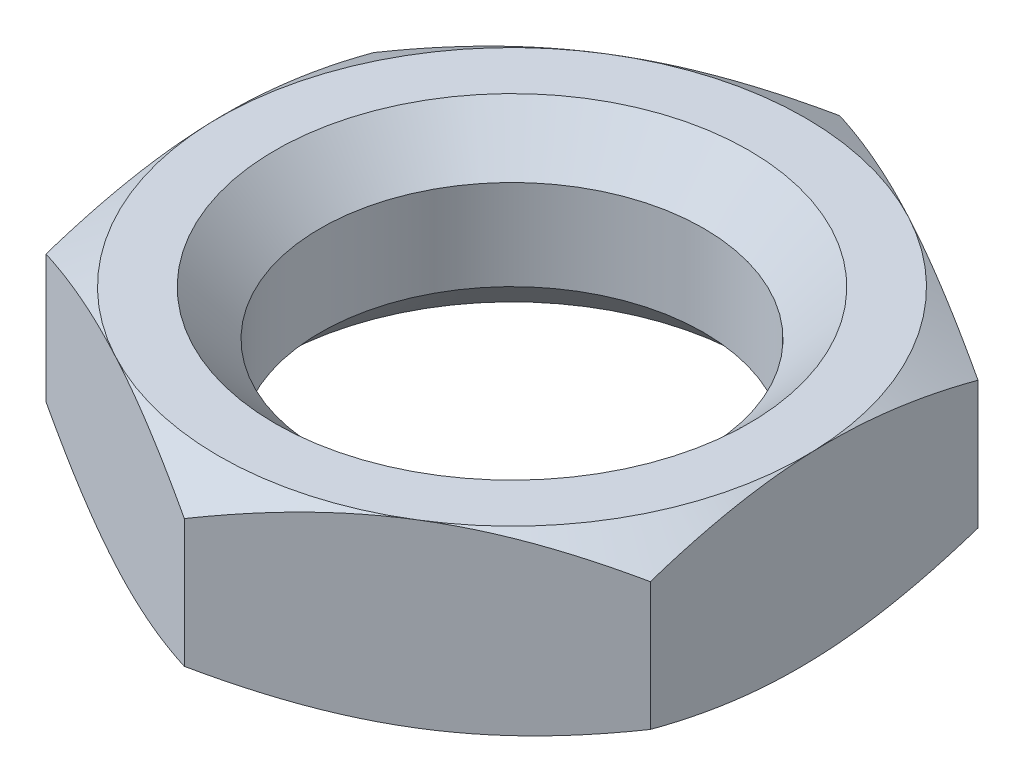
ISO-10303-21;
HEADER;
FILE_DESCRIPTION(('STEP AP214'),'2;1');
FILE_NAME('part.step','',(''),(''),'','','');
FILE_SCHEMA(('AUTOMOTIVE_DESIGN { 1 0 10303 214 1 1 1 1 }'));
ENDSEC;
DATA;
#1=APPLICATION_CONTEXT('core data for automotive mechanical design processes');
#2=APPLICATION_PROTOCOL_DEFINITION('international standard','automotive_design',2000,#1);
#3=PRODUCT_CONTEXT('',#1,'mechanical');
#4=PRODUCT('Part','Part','',(#3));
#5=PRODUCT_RELATED_PRODUCT_CATEGORY('part','',(#4));
#6=PRODUCT_DEFINITION_FORMATION('','',#4);
#7=PRODUCT_DEFINITION_CONTEXT('part definition',#1,'design');
#8=PRODUCT_DEFINITION('design','',#6,#7);
#9=PRODUCT_DEFINITION_SHAPE('','',#8);
#10=(LENGTH_UNIT() NAMED_UNIT(*) SI_UNIT(.MILLI.,.METRE.));
#11=(NAMED_UNIT(*) PLANE_ANGLE_UNIT() SI_UNIT($,.RADIAN.));
#12=(NAMED_UNIT(*) SI_UNIT($,.STERADIAN.) SOLID_ANGLE_UNIT());
#13=UNCERTAINTY_MEASURE_WITH_UNIT(LENGTH_MEASURE(1.E-05),#10,'distance_accuracy_value','');
#14=(GEOMETRIC_REPRESENTATION_CONTEXT(3) GLOBAL_UNCERTAINTY_ASSIGNED_CONTEXT((#13)) GLOBAL_UNIT_ASSIGNED_CONTEXT((#10,
#11,#12)) REPRESENTATION_CONTEXT('',''));
#15=CARTESIAN_POINT('',(0.,0.,0.));
#16=DIRECTION('',(0.,0.,1.));
#17=DIRECTION('',(1.,0.,0.));
#18=AXIS2_PLACEMENT_3D('',#15,#16,#17);
#19=CARTESIAN_POINT('',(6.61460290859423,4.,3.54688055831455));
#20=DIRECTION('',(-0.999507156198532,0.,0.0313917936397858));
#21=DIRECTION('',(0.0313917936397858,0.,0.999507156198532));
#22=AXIS2_PLACEMENT_3D('',#19,#20,#21);
#23=PLANE('',#22);
#24=CARTESIAN_POINT('',(6.37898384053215,0.580614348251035,-3.95517387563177));
#25=CARTESIAN_POINT('',(6.38416287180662,0.532995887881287,-3.79027476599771));
#26=CARTESIAN_POINT('',(6.38936121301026,0.487538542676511,-3.62476083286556));
#27=CARTESIAN_POINT('',(6.399800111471,0.401541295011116,-3.29238881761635));
#28=CARTESIAN_POINT('',(6.40504068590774,0.361003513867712,-3.12553018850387));
#29=CARTESIAN_POINT('',(6.42084631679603,0.247565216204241,-2.62228270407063));
#30=CARTESIAN_POINT('',(6.43147376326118,0.183042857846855,-2.28390736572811));
#31=CARTESIAN_POINT('',(6.44737754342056,0.107382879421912,-1.7775348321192));
#32=CARTESIAN_POINT('',(6.4526063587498,0.0858295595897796,-1.61105061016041));
#33=CARTESIAN_POINT('',(6.46308761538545,0.0496878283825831,-1.27732992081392));
#34=CARTESIAN_POINT('',(6.46834005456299,0.035098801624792,-1.11009352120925));
#35=CARTESIAN_POINT('',(6.47885405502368,0.013257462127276,-0.775330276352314));
#36=CARTESIAN_POINT('',(6.48411559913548,0.00599682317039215,-0.607803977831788));
#37=CARTESIAN_POINT('',(6.49464325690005,-0.00103984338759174,-0.272605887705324));
#38=CARTESIAN_POINT('',(6.49990937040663,-0.000816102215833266,-0.104934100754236));
#39=CARTESIAN_POINT('',(6.51433671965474,0.0100845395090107,0.354429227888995));
#40=CARTESIAN_POINT('',(6.52349323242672,0.0283830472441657,0.645970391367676));
#41=CARTESIAN_POINT('',(6.54174544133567,0.0864071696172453,1.22711633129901));
#42=CARTESIAN_POINT('',(6.55084107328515,0.126152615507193,1.51671906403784));
#43=CARTESIAN_POINT('',(6.56913001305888,0.225504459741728,2.09903450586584));
#44=CARTESIAN_POINT('',(6.57832101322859,0.285531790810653,2.39167373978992));
#45=CARTESIAN_POINT('',(6.59656595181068,0.421769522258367,2.97258819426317));
#46=CARTESIAN_POINT('',(6.60562012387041,0.49794792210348,3.26087085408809));
#47=CARTESIAN_POINT('',(6.61460919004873,0.580614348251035,3.54708055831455));
#48=B_SPLINE_CURVE_WITH_KNOTS('',3,(#24,#25,#26,#27,#28,#29,#30,#31,#32,#33,#34,#35,#36,#37,#38,
#39,#40,#41,#42,#43,#44,#45,#46,#47),.UNSPECIFIED.,.F.,.F.,(4,2,2,2,2,2,2,2,2,2,2,4),(0.,
0.515103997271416,1.03042932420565,2.06322126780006,2.56696865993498,3.07067153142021,
3.57380146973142,4.0769158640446,4.95277182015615,5.82943904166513,6.72554927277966,
7.61990033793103),.UNSPECIFIED.);
#49=CARTESIAN_POINT('',(6.37899012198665,0.580556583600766,-3.95497387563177));
#50=VERTEX_POINT('',#49);
#51=CARTESIAN_POINT('',(6.49679651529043,0.,-0.204046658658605));
#52=VERTEX_POINT('',#51);
#53=EDGE_CURVE('E438',#50,#52,#48,.T.);
#54=ORIENTED_EDGE('',*,*,#53,.F.);
#55=DIRECTION('',(0.,-1.,0.));
#56=VECTOR('',#55,1.);
#57=CARTESIAN_POINT('',(6.37899012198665,4.,-3.95497387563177));
#58=LINE('',#57,#56);
#59=CARTESIAN_POINT('',(6.37899012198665,3.41944341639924,-3.95497387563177));
#60=VERTEX_POINT('',#59);
#61=EDGE_CURVE('E554',#60,#50,#58,.T.);
#62=ORIENTED_EDGE('',*,*,#61,.F.);
#63=CARTESIAN_POINT('',(6.61460919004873,3.41938565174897,3.54708055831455));
#64=CARTESIAN_POINT('',(6.60943015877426,3.46700411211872,3.3821814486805));
#65=CARTESIAN_POINT('',(6.60423181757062,3.5124614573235,3.21666751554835));
#66=CARTESIAN_POINT('',(6.59379291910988,3.59845870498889,2.88429550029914));
#67=CARTESIAN_POINT('',(6.58855234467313,3.6389964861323,2.71743687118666));
#68=CARTESIAN_POINT('',(6.57274671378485,3.75243478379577,2.21418938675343));
#69=CARTESIAN_POINT('',(6.5621192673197,3.81695714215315,1.8758140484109));
#70=CARTESIAN_POINT('',(6.54621548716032,3.8926171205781,1.36944151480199));
#71=CARTESIAN_POINT('',(6.54098667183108,3.91417044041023,1.2029572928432));
#72=CARTESIAN_POINT('',(6.53050541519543,3.95031217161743,0.86923660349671));
#73=CARTESIAN_POINT('',(6.52525297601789,3.96490119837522,0.702000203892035));
#74=CARTESIAN_POINT('',(6.5147389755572,3.98674253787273,0.367236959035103));
#75=CARTESIAN_POINT('',(6.5094774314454,3.99400317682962,0.199710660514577));
#76=CARTESIAN_POINT('',(6.49894977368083,4.0010398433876,-0.135487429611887));
#77=CARTESIAN_POINT('',(6.49368366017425,4.00081610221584,-0.303159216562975));
#78=CARTESIAN_POINT('',(6.47925631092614,3.989915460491,-0.762522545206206));
#79=CARTESIAN_POINT('',(6.47009979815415,3.97161695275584,-1.05406370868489));
#80=CARTESIAN_POINT('',(6.45184758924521,3.91359283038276,-1.63520964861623));
#81=CARTESIAN_POINT('',(6.44275195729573,3.87384738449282,-1.92481238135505));
#82=CARTESIAN_POINT('',(6.424463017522,3.77449554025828,-2.50712782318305));
#83=CARTESIAN_POINT('',(6.41527201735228,3.71446820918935,-2.79976705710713));
#84=CARTESIAN_POINT('',(6.3970270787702,3.57823047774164,-3.38068151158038));
#85=CARTESIAN_POINT('',(6.38797290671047,3.50205207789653,-3.6689641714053));
#86=CARTESIAN_POINT('',(6.37898384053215,3.41938565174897,-3.95517387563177));
#87=B_SPLINE_CURVE_WITH_KNOTS('',3,(#63,#64,#65,#66,#67,#68,#69,#70,#71,#72,#73,#74,#75,#76,#77,
#78,#79,#80,#81,#82,#83,#84,#85,#86),.UNSPECIFIED.,.F.,.F.,(4,2,2,2,2,2,2,2,2,2,2,4),(0.,
0.515103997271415,1.03042932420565,2.06322126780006,2.56696865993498,3.07067153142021,
3.57380146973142,4.0769158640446,4.95277182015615,5.82943904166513,6.72554927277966,
7.61990033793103),.UNSPECIFIED.);
#88=CARTESIAN_POINT('',(6.49679651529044,4.,-0.204046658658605));
#89=VERTEX_POINT('',#88);
#90=EDGE_CURVE('E535',#89,#60,#87,.T.);
#91=ORIENTED_EDGE('',*,*,#90,.F.);
#92=CARTESIAN_POINT('',(6.61460290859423,3.41944341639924,3.54688055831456));
#93=VERTEX_POINT('',#92);
#94=EDGE_CURVE('E540',#93,#89,#87,.T.);
#95=ORIENTED_EDGE('',*,*,#94,.F.);
#96=DIRECTION('',(0.,-1.,0.));
#97=VECTOR('',#96,1.);
#98=CARTESIAN_POINT('',(6.61460290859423,4.,3.54688055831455));
#99=LINE('',#98,#97);
#100=CARTESIAN_POINT('',(6.61460290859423,0.580556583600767,3.54688055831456));
#101=VERTEX_POINT('',#100);
#102=EDGE_CURVE('E464',#93,#101,#99,.T.);
#103=ORIENTED_EDGE('',*,*,#102,.T.);
#104=EDGE_CURVE('E447',#52,#101,#48,.T.);
#105=ORIENTED_EDGE('',*,*,#104,.F.);
#106=EDGE_LOOP('',(#54,#62,#91,#95,#103,#105));
#107=FACE_BOUND('',#106,.T.);
#108=ADVANCED_FACE('F351',(#107),#23,.F.);
#109=CARTESIAN_POINT('',(6.37899012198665,4.,-3.95497387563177));
#110=DIRECTION('',(-0.472567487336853,0.,0.881294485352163));
#111=DIRECTION('',(0.881294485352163,0.,0.472567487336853));
#112=AXIS2_PLACEMENT_3D('',#109,#110,#111);
#113=PLANE('',#112);
#114=CARTESIAN_POINT('',(-0.235812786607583,0.580622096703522,-7.50196167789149));
#115=CARTESIAN_POINT('',(-0.0904162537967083,0.533003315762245,-7.42399718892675));
#116=CARTESIAN_POINT('',(0.0555223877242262,0.487545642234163,-7.34574201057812));
#117=CARTESIAN_POINT('',(0.348584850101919,0.401547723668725,-7.1885961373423));
#118=CARTESIAN_POINT('',(0.495709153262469,0.361009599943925,-7.1097051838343));
#119=CARTESIAN_POINT('',(0.939437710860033,0.247570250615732,-6.87176917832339));
#120=CARTESIAN_POINT('',(1.23779351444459,0.183047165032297,-6.71178491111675));
#121=CARTESIAN_POINT('',(1.68427754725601,0.10738610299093,-6.47237136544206));
#122=CARTESIAN_POINT('',(1.8310717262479,0.0858324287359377,-6.39365743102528));
#123=CARTESIAN_POINT('',(2.12532337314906,0.0496899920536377,-6.23587389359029));
#124=CARTESIAN_POINT('',(2.27278078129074,0.0351006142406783,-6.15680432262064));
#125=CARTESIAN_POINT('',(2.56795170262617,0.0132585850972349,-5.99852785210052));
#126=CARTESIAN_POINT('',(2.71566473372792,0.00599760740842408,-5.91932121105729));
#127=CARTESIAN_POINT('',(3.01121909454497,-0.0010397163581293,-5.76083913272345));
#128=CARTESIAN_POINT('',(3.15906042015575,-0.00081629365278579,-5.68156369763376));
#129=CARTESIAN_POINT('',(3.56409815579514,0.0100835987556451,-5.46437447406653));
#130=CARTESIAN_POINT('',(3.82116198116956,0.0283819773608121,-5.32653178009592));
#131=CARTESIAN_POINT('',(4.33358223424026,0.0864064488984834,-5.05176193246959));
#132=CARTESIAN_POINT('',(4.58893685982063,0.126152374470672,-4.91483574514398));
#133=CARTESIAN_POINT('',(5.10238836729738,0.225505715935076,-4.63951291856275));
#134=CARTESIAN_POINT('',(5.36042046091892,0.285534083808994,-4.50115102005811));
#135=CARTESIAN_POINT('',(5.87263664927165,0.421774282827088,-4.22649059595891));
#136=CARTESIAN_POINT('',(6.12682730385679,0.497954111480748,-4.09018855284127));
#137=CARTESIAN_POINT('',(6.37919012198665,0.580622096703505,-3.95486663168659));
#138=B_SPLINE_CURVE_WITH_KNOTS('',3,(#114,#115,#116,#117,#118,#119,#120,#121,#122,#123,#124,
#125,#126,#127,#128,#129,#130,#131,#132,#133,#134,#135,#136,#137),.UNSPECIFIED.,.F.,.F.,(4,2,2,
2,2,2,2,2,2,2,2,4),(0.,0.515104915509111,1.03043116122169,2.06322499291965,2.5669732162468,
3.07067691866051,3.57380767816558,4.07692289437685,4.95279072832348,5.82946987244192,
6.72559265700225,7.61995618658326),.UNSPECIFIED.);
#139=CARTESIAN_POINT('',(-0.235612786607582,0.580556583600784,-7.50185443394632));
#140=VERTEX_POINT('',#139);
#141=CARTESIAN_POINT('',(3.07168866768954,0.,-5.728414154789));
#142=VERTEX_POINT('',#141);
#143=EDGE_CURVE('E507',#140,#142,#138,.T.);
#144=ORIENTED_EDGE('',*,*,#143,.F.);
#145=DIRECTION('',(0.,-1.,0.));
#146=VECTOR('',#145,1.);
#147=CARTESIAN_POINT('',(-0.235612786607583,4.,-7.50185443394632));
#148=LINE('',#147,#146);
#149=CARTESIAN_POINT('',(-0.235612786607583,3.41944341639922,-7.50185443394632));
#150=VERTEX_POINT('',#149);
#151=EDGE_CURVE('E551',#150,#140,#148,.T.);
#152=ORIENTED_EDGE('',*,*,#151,.F.);
#153=CARTESIAN_POINT('',(6.37919012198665,3.4193779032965,-3.95486663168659));
#154=CARTESIAN_POINT('',(6.23379358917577,3.46699668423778,-4.03283112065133));
#155=CARTESIAN_POINT('',(6.08785494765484,3.51245435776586,-4.11108629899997));
#156=CARTESIAN_POINT('',(5.79479248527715,3.5984522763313,-4.26823217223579));
#157=CARTESIAN_POINT('',(5.6476681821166,3.6389904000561,-4.34712312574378));
#158=CARTESIAN_POINT('',(5.20393962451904,3.75242974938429,-4.58505913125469));
#159=CARTESIAN_POINT('',(4.90558382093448,3.81695283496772,-4.74504339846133));
#160=CARTESIAN_POINT('',(4.45909978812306,3.89261389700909,-4.98445694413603));
#161=CARTESIAN_POINT('',(4.31230560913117,3.91416757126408,-5.0631708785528));
#162=CARTESIAN_POINT('',(4.01805396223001,3.95031000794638,-5.22095441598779));
#163=CARTESIAN_POINT('',(3.87059655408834,3.96489938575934,-5.30002398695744));
#164=CARTESIAN_POINT('',(3.57542563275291,3.98674141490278,-5.45830045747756));
#165=CARTESIAN_POINT('',(3.42771260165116,3.99400239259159,-5.53750709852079));
#166=CARTESIAN_POINT('',(3.1321582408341,4.00103971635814,-5.69598917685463));
#167=CARTESIAN_POINT('',(2.98431691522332,4.00081629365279,-5.77526461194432));
#168=CARTESIAN_POINT('',(2.57927917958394,3.98991640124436,-5.99245383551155));
#169=CARTESIAN_POINT('',(2.32221535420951,3.97161802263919,-6.13029652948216));
#170=CARTESIAN_POINT('',(1.80979510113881,3.91359355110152,-6.40506637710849));
#171=CARTESIAN_POINT('',(1.55444047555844,3.87384762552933,-6.5419925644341));
#172=CARTESIAN_POINT('',(1.04098896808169,3.77449428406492,-6.81731539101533));
#173=CARTESIAN_POINT('',(0.782956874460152,3.714465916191,-6.95567728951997));
#174=CARTESIAN_POINT('',(0.270740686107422,3.5782257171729,-7.23033771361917));
#175=CARTESIAN_POINT('',(0.0165500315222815,3.50204588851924,-7.36663975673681));
#176=CARTESIAN_POINT('',(-0.235812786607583,3.41937790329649,-7.50196167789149));
#177=B_SPLINE_CURVE_WITH_KNOTS('',3,(#153,#154,#155,#156,#157,#158,#159,#160,#161,#162,#163,
#164,#165,#166,#167,#168,#169,#170,#171,#172,#173,#174,#175,#176),.UNSPECIFIED.,.F.,.F.,(4,2,2,
2,2,2,2,2,2,2,2,4),(0.,0.515104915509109,1.03043116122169,2.06322499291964,2.56697321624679,
3.0706769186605,3.57380767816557,4.07692289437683,4.95279072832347,5.82946987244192,
6.72559265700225,7.61995618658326),.UNSPECIFIED.);
#178=CARTESIAN_POINT('',(3.07168866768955,4.,-5.72841415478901));
#179=VERTEX_POINT('',#178);
#180=EDGE_CURVE('E522',#179,#150,#177,.T.);
#181=ORIENTED_EDGE('',*,*,#180,.F.);
#182=EDGE_CURVE('E528',#60,#179,#177,.T.);
#183=ORIENTED_EDGE('',*,*,#182,.F.);
#184=ORIENTED_EDGE('',*,*,#61,.T.);
#185=EDGE_CURVE('E441',#142,#50,#138,.T.);
#186=ORIENTED_EDGE('',*,*,#185,.F.);
#187=EDGE_LOOP('',(#144,#152,#181,#183,#184,#186));
#188=FACE_BOUND('',#187,.T.);
#189=ADVANCED_FACE('F514',(#188),#113,.F.);
#190=CARTESIAN_POINT('',(-0.235612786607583,4.,-7.50185443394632));
#191=DIRECTION('',(0.52693966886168,0.,0.849902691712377));
#192=DIRECTION('',(0.849902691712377,0.,-0.52693966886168));
#193=AXIS2_PLACEMENT_3D('',#190,#191,#192);
#194=PLANE('',#193);
#195=CARTESIAN_POINT('',(-6.61480290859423,0.580624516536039,-3.54675655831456));
#196=CARTESIAN_POINT('',(-6.47458535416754,0.533005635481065,-3.6336914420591));
#197=CARTESIAN_POINT('',(-6.33384500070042,0.487547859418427,-3.72095046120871));
#198=CARTESIAN_POINT('',(-6.05122132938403,0.401549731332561,-3.89617713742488));
#199=CARTESIAN_POINT('',(-5.90933754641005,0.361011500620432,-3.98414508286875));
#200=CARTESIAN_POINT('',(-5.48141445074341,0.24757182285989,-4.24945740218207));
#201=CARTESIAN_POINT('',(-5.19368597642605,0.183048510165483,-4.42784905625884));
#202=CARTESIAN_POINT('',(-4.76310554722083,0.107387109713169,-4.69480892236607));
#203=CARTESIAN_POINT('',(-4.62154012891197,0.0858333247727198,-4.78257948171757));
#204=CARTESIAN_POINT('',(-4.33776962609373,0.0496906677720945,-4.95851719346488));
#205=CARTESIAN_POINT('',(-4.19556459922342,0.0351011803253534,-5.04668431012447));
#206=CARTESIAN_POINT('',(-3.91090755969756,0.0132589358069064,-5.22317167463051));
#207=CARTESIAN_POINT('',(-3.76845601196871,0.00599785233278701,-5.3114916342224));
#208=CARTESIAN_POINT('',(-3.48342918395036,-0.00103967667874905,-5.48820826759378));
#209=CARTESIAN_POINT('',(-3.34085390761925,-0.000816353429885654,-5.57660493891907));
#210=CARTESIAN_POINT('',(-2.95024252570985,0.0100833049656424,-5.8187839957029));
#211=CARTESIAN_POINT('',(-2.70233427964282,0.0283816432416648,-5.97248710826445));
#212=CARTESIAN_POINT('',(-2.20816437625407,0.0864062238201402,-6.27887244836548));
#213=CARTESIAN_POINT('',(-1.96190445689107,0.126152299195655,-6.43155359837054));
#214=CARTESIAN_POINT('',(-1.46674001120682,0.225506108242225,-6.73855555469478));
#215=CARTESIAN_POINT('',(-1.21789796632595,0.285534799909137,-6.89283762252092));
#216=CARTESIAN_POINT('',(-0.723924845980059,0.4217757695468,-7.19910095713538));
#217=CARTESIAN_POINT('',(-0.47878744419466,0.497956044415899,-7.35108614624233));
#218=CARTESIAN_POINT('',(-0.235412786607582,0.580624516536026,-7.50197843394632));
#219=B_SPLINE_CURVE_WITH_KNOTS('',3,(#195,#196,#197,#198,#199,#200,#201,#202,#203,#204,#205,
#206,#207,#208,#209,#210,#211,#212,#213,#214,#215,#216,#217,#218),.UNSPECIFIED.,.F.,.F.,(4,2,2,
2,2,2,2,2,2,2,2,4),(0.,0.515105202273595,1.0304317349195,2.06322615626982,2.56697463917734,
3.07067860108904,3.57380961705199,4.07692508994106,4.95279663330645,5.82947950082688,
6.72560620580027,7.61997362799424),.UNSPECIFIED.);
#220=CARTESIAN_POINT('',(-6.61460290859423,0.580556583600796,-3.54688055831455));
#221=VERTEX_POINT('',#220);
#222=CARTESIAN_POINT('',(-3.42510784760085,0.,-5.52436749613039));
#223=VERTEX_POINT('',#222);
#224=EDGE_CURVE('E636',#221,#223,#219,.T.);
#225=ORIENTED_EDGE('',*,*,#224,.F.);
#226=DIRECTION('',(0.,-1.,0.));
#227=VECTOR('',#226,1.);
#228=CARTESIAN_POINT('',(-6.61460290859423,4.,-3.54688055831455));
#229=LINE('',#228,#227);
#230=CARTESIAN_POINT('',(-6.61460290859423,3.41944341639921,-3.54688055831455));
#231=VERTEX_POINT('',#230);
#232=EDGE_CURVE('E548',#231,#221,#229,.T.);
#233=ORIENTED_EDGE('',*,*,#232,.F.);
#234=CARTESIAN_POINT('',(-0.235412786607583,3.41937548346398,-7.50197843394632));
#235=CARTESIAN_POINT('',(-0.375630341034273,3.46699436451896,-7.41504355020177));
#236=CARTESIAN_POINT('',(-0.516370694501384,3.51245214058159,-7.32778453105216));
#237=CARTESIAN_POINT('',(-0.798994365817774,3.59845026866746,-7.152557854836));
#238=CARTESIAN_POINT('',(-0.940878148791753,3.63898849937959,-7.06458990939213));
#239=CARTESIAN_POINT('',(-1.36880124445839,3.75242817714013,-6.79927759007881));
#240=CARTESIAN_POINT('',(-1.65652971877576,3.81695148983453,-6.62088593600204));
#241=CARTESIAN_POINT('',(-2.08711014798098,3.89261289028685,-6.3539260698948));
#242=CARTESIAN_POINT('',(-2.22867556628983,3.91416667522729,-6.26615551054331));
#243=CARTESIAN_POINT('',(-2.51244606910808,3.95030933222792,-6.090217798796));
#244=CARTESIAN_POINT('',(-2.65465109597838,3.96489881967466,-6.00205068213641));
#245=CARTESIAN_POINT('',(-2.93930813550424,3.9867410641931,-5.82556331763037));
#246=CARTESIAN_POINT('',(-3.0817596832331,3.99400214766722,-5.73724335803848));
#247=CARTESIAN_POINT('',(-3.36678651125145,4.00103967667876,-5.5605267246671));
#248=CARTESIAN_POINT('',(-3.50936178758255,4.00081635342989,-5.47213005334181));
#249=CARTESIAN_POINT('',(-3.89997316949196,3.98991669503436,-5.22995099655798));
#250=CARTESIAN_POINT('',(-4.14788141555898,3.97161835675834,-5.07624788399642));
#251=CARTESIAN_POINT('',(-4.64205131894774,3.91359377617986,-4.76986254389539));
#252=CARTESIAN_POINT('',(-4.88831123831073,3.87384770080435,-4.61718139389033));
#253=CARTESIAN_POINT('',(-5.38347568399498,3.77449389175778,-4.3101794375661));
#254=CARTESIAN_POINT('',(-5.63231772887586,3.71446520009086,-4.15589736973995));
#255=CARTESIAN_POINT('',(-6.12629084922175,3.5782242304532,-3.84963403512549));
#256=CARTESIAN_POINT('',(-6.37142825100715,3.5020439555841,-3.69764884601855));
#257=CARTESIAN_POINT('',(-6.61480290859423,3.41937548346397,-3.54675655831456));
#258=B_SPLINE_CURVE_WITH_KNOTS('',3,(#234,#235,#236,#237,#238,#239,#240,#241,#242,#243,#244,
#245,#246,#247,#248,#249,#250,#251,#252,#253,#254,#255,#256,#257),.UNSPECIFIED.,.F.,.F.,(4,2,2,
2,2,2,2,2,2,2,2,4),(0.,0.515105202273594,1.0304317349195,2.06322615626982,2.56697463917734,
3.07067860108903,3.57380961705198,4.07692508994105,4.95279663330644,5.82947950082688,
6.72560620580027,7.61997362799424),.UNSPECIFIED.);
#259=CARTESIAN_POINT('',(-3.42510784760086,4.,-5.52436749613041));
#260=VERTEX_POINT('',#259);
#261=EDGE_CURVE('E530',#260,#231,#258,.T.);
#262=ORIENTED_EDGE('',*,*,#261,.F.);
#263=EDGE_CURVE('E529',#150,#260,#258,.T.);
#264=ORIENTED_EDGE('',*,*,#263,.F.);
#265=ORIENTED_EDGE('',*,*,#151,.T.);
#266=EDGE_CURVE('E508',#223,#140,#219,.T.);
#267=ORIENTED_EDGE('',*,*,#266,.F.);
#268=EDGE_LOOP('',(#225,#233,#262,#264,#265,#267));
#269=FACE_BOUND('',#268,.T.);
#270=ADVANCED_FACE('F517',(#269),#194,.F.);
#271=CARTESIAN_POINT('',(-6.61460290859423,4.,-3.54688055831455));
#272=DIRECTION('',(0.999507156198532,0.,-0.0313917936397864));
#273=DIRECTION('',(-0.0313917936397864,0.,-0.999507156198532));
#274=AXIS2_PLACEMENT_3D('',#271,#272,#273);
#275=PLANE('',#274);
#276=CARTESIAN_POINT('',(-6.37898384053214,0.580614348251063,3.95517387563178));
#277=CARTESIAN_POINT('',(-6.38416287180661,0.532995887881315,3.79027476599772));
#278=CARTESIAN_POINT('',(-6.38936121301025,0.487538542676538,3.62476083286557));
#279=CARTESIAN_POINT('',(-6.39980011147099,0.401541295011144,3.29238881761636));
#280=CARTESIAN_POINT('',(-6.40504068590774,0.36100351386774,3.12553018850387));
#281=CARTESIAN_POINT('',(-6.42084631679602,0.24756521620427,2.62228270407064));
#282=CARTESIAN_POINT('',(-6.43147376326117,0.183042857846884,2.28390736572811));
#283=CARTESIAN_POINT('',(-6.44737754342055,0.107382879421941,1.7775348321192));
#284=CARTESIAN_POINT('',(-6.45260635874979,0.0858295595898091,1.6110506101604));
#285=CARTESIAN_POINT('',(-6.46308761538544,0.0496878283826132,1.27732992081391));
#286=CARTESIAN_POINT('',(-6.46834005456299,0.0350988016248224,1.11009352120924));
#287=CARTESIAN_POINT('',(-6.47885405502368,0.0132574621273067,0.775330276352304));
#288=CARTESIAN_POINT('',(-6.48411559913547,0.00599682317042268,0.607803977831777));
#289=CARTESIAN_POINT('',(-6.49464325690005,-0.00103984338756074,0.272605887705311));
#290=CARTESIAN_POINT('',(-6.49990937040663,-0.00081610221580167,0.104934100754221));
#291=CARTESIAN_POINT('',(-6.51433671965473,0.0100845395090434,-0.354429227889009));
#292=CARTESIAN_POINT('',(-6.52349323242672,0.0283830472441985,-0.645970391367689));
#293=CARTESIAN_POINT('',(-6.54174544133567,0.0864071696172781,-1.22711633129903));
#294=CARTESIAN_POINT('',(-6.55084107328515,0.126152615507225,-1.51671906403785));
#295=CARTESIAN_POINT('',(-6.56913001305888,0.22550445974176,-2.09903450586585));
#296=CARTESIAN_POINT('',(-6.57832101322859,0.285531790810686,-2.39167373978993));
#297=CARTESIAN_POINT('',(-6.59656595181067,0.421769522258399,-2.97258819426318));
#298=CARTESIAN_POINT('',(-6.6056201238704,0.497947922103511,-3.26087085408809));
#299=CARTESIAN_POINT('',(-6.61460919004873,0.580614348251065,-3.54708055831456));
#300=B_SPLINE_CURVE_WITH_KNOTS('',3,(#276,#277,#278,#279,#280,#281,#282,#283,#284,#285,#286,
#287,#288,#289,#290,#291,#292,#293,#294,#295,#296,#297,#298,#299),.UNSPECIFIED.,.F.,.F.,(4,2,2,
2,2,2,2,2,2,2,2,4),(0.,0.515103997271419,1.03042932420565,2.06322126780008,2.56696865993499,
3.07067153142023,3.57380146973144,4.07691586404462,4.95277182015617,5.82943904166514,
6.72554927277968,7.61990033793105),.UNSPECIFIED.);
#301=CARTESIAN_POINT('',(-6.37899012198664,0.580556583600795,3.95497387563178));
#302=VERTEX_POINT('',#301);
#303=CARTESIAN_POINT('',(-6.49679651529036,0.,0.20404665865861));
#304=VERTEX_POINT('',#303);
#305=EDGE_CURVE('E477',#302,#304,#300,.T.);
#306=ORIENTED_EDGE('',*,*,#305,.F.);
#307=DIRECTION('',(0.,-1.,0.));
#308=VECTOR('',#307,1.);
#309=CARTESIAN_POINT('',(-6.37899012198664,4.,3.95497387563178));
#310=LINE('',#309,#308);
#311=CARTESIAN_POINT('',(-6.37899012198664,3.41944341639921,3.95497387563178));
#312=VERTEX_POINT('',#311);
#313=EDGE_CURVE('E545',#312,#302,#310,.T.);
#314=ORIENTED_EDGE('',*,*,#313,.F.);
#315=CARTESIAN_POINT('',(-6.61460919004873,3.41938565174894,-3.54708055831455));
#316=CARTESIAN_POINT('',(-6.60943015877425,3.46700411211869,-3.3821814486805));
#317=CARTESIAN_POINT('',(-6.60423181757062,3.51246145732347,-3.21666751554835));
#318=CARTESIAN_POINT('',(-6.59379291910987,3.59845870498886,-2.88429550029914));
#319=CARTESIAN_POINT('',(-6.58855234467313,3.63899648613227,-2.71743687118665));
#320=CARTESIAN_POINT('',(-6.57274671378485,3.75243478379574,-2.21418938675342));
#321=CARTESIAN_POINT('',(-6.56211926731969,3.81695714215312,-1.87581404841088));
#322=CARTESIAN_POINT('',(-6.54621548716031,3.89261712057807,-1.36944151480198));
#323=CARTESIAN_POINT('',(-6.54098667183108,3.9141704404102,-1.20295729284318));
#324=CARTESIAN_POINT('',(-6.53050541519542,3.9503121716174,-0.869236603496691));
#325=CARTESIAN_POINT('',(-6.52525297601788,3.96490119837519,-0.702000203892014));
#326=CARTESIAN_POINT('',(-6.51473897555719,3.9867425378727,-0.36723695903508));
#327=CARTESIAN_POINT('',(-6.50947743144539,3.99400317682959,-0.199710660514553));
#328=CARTESIAN_POINT('',(-6.49894977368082,4.00103984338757,0.135487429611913));
#329=CARTESIAN_POINT('',(-6.49368366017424,4.00081610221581,0.303159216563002));
#330=CARTESIAN_POINT('',(-6.47925631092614,3.98991546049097,0.762522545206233));
#331=CARTESIAN_POINT('',(-6.47009979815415,3.97161695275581,1.05406370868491));
#332=CARTESIAN_POINT('',(-6.4518475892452,3.91359283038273,1.63520964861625));
#333=CARTESIAN_POINT('',(-6.44275195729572,3.87384738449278,1.92481238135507));
#334=CARTESIAN_POINT('',(-6.42446301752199,3.77449554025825,2.50712782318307));
#335=CARTESIAN_POINT('',(-6.41527201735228,3.71446820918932,2.79976705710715));
#336=CARTESIAN_POINT('',(-6.39702707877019,3.57823047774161,3.3806815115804));
#337=CARTESIAN_POINT('',(-6.38797290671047,3.5020520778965,3.66896417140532));
#338=CARTESIAN_POINT('',(-6.37898384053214,3.41938565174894,3.95517387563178));
#339=B_SPLINE_CURVE_WITH_KNOTS('',3,(#315,#316,#317,#318,#319,#320,#321,#322,#323,#324,#325,
#326,#327,#328,#329,#330,#331,#332,#333,#334,#335,#336,#337,#338),.UNSPECIFIED.,.F.,.F.,(4,2,2,
2,2,2,2,2,2,2,2,4),(0.,0.515103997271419,1.03042932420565,2.06322126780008,2.566968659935,
3.07067153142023,3.57380146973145,4.07691586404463,4.95277182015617,5.82943904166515,
6.72554927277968,7.61990033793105),.UNSPECIFIED.);
#340=CARTESIAN_POINT('',(-6.49679651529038,4.,0.204046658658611));
#341=VERTEX_POINT('',#340);
#342=EDGE_CURVE('E590',#341,#312,#339,.T.);
#343=ORIENTED_EDGE('',*,*,#342,.F.);
#344=EDGE_CURVE('E603',#231,#341,#339,.T.);
#345=ORIENTED_EDGE('',*,*,#344,.F.);
#346=ORIENTED_EDGE('',*,*,#232,.T.);
#347=EDGE_CURVE('E640',#304,#221,#300,.T.);
#348=ORIENTED_EDGE('',*,*,#347,.F.);
#349=EDGE_LOOP('',(#306,#314,#343,#345,#346,#348));
#350=FACE_BOUND('',#349,.T.);
#351=ADVANCED_FACE('F602',(#350),#275,.F.);
#352=CARTESIAN_POINT('',(-6.37899012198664,4.,3.95497387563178));
#353=DIRECTION('',(0.472567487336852,0.,-0.881294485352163));
#354=DIRECTION('',(-0.881294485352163,0.,-0.472567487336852));
#355=AXIS2_PLACEMENT_3D('',#352,#353,#354);
#356=PLANE('',#355);
#357=CARTESIAN_POINT('',(0.235812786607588,0.580622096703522,7.50196167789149));
#358=CARTESIAN_POINT('',(0.0904162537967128,0.533003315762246,7.42399718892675));
#359=CARTESIAN_POINT('',(-0.0555223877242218,0.487545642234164,7.34574201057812));
#360=CARTESIAN_POINT('',(-0.348584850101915,0.401547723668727,7.1885961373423));
#361=CARTESIAN_POINT('',(-0.495709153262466,0.361009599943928,7.10970518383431));
#362=CARTESIAN_POINT('',(-0.93943771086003,0.247570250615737,6.8717691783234));
#363=CARTESIAN_POINT('',(-1.23779351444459,0.183047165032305,6.71178491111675));
#364=CARTESIAN_POINT('',(-1.68427754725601,0.10738610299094,6.47237136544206));
#365=CARTESIAN_POINT('',(-1.8310717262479,0.0858324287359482,6.39365743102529));
#366=CARTESIAN_POINT('',(-2.12532337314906,0.0496899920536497,6.2358738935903));
#367=CARTESIAN_POINT('',(-2.27278078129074,0.0351006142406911,6.15680432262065));
#368=CARTESIAN_POINT('',(-2.56795170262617,0.0132585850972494,5.99852785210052));
#369=CARTESIAN_POINT('',(-2.71566473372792,0.00599760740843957,5.91932121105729));
#370=CARTESIAN_POINT('',(-3.01121909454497,-0.00103971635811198,5.76083913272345));
#371=CARTESIAN_POINT('',(-3.15906042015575,-0.000816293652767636,5.68156369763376));
#372=CARTESIAN_POINT('',(-3.56409815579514,0.0100835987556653,5.46437447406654));
#373=CARTESIAN_POINT('',(-3.82116198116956,0.0283819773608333,5.32653178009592));
#374=CARTESIAN_POINT('',(-4.33358223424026,0.086406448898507,5.0517619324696));
#375=CARTESIAN_POINT('',(-4.58893685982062,0.126152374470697,4.91483574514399));
#376=CARTESIAN_POINT('',(-5.10238836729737,0.225505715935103,4.63951291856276));
#377=CARTESIAN_POINT('',(-5.36042046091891,0.285534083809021,4.50115102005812));
#378=CARTESIAN_POINT('',(-5.87263664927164,0.421774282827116,4.22649059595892));
#379=CARTESIAN_POINT('',(-6.12682730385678,0.497954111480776,4.09018855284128));
#380=CARTESIAN_POINT('',(-6.37919012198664,0.580622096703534,3.95486663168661));
#381=B_SPLINE_CURVE_WITH_KNOTS('',3,(#357,#358,#359,#360,#361,#362,#363,#364,#365,#366,#367,
#368,#369,#370,#371,#372,#373,#374,#375,#376,#377,#378,#379,#380),.UNSPECIFIED.,.F.,.F.,(4,2,2,
2,2,2,2,2,2,2,2,4),(0.,0.515104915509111,1.0304311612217,2.06322499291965,2.5669732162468,
3.07067691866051,3.57380767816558,4.07692289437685,4.95279072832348,5.82946987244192,
6.72559265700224,7.61995618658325),.UNSPECIFIED.);
#382=CARTESIAN_POINT('',(0.235612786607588,0.580556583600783,7.50185443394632));
#383=VERTEX_POINT('',#382);
#384=CARTESIAN_POINT('',(-3.07168866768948,0.,5.728414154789));
#385=VERTEX_POINT('',#384);
#386=EDGE_CURVE('E465',#383,#385,#381,.T.);
#387=ORIENTED_EDGE('',*,*,#386,.F.);
#388=DIRECTION('',(0.,-1.,0.));
#389=VECTOR('',#388,1.);
#390=CARTESIAN_POINT('',(0.235612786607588,4.,7.50185443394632));
#391=LINE('',#390,#389);
#392=CARTESIAN_POINT('',(0.235612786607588,3.41944341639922,7.50185443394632));
#393=VERTEX_POINT('',#392);
#394=EDGE_CURVE('E542',#393,#383,#391,.T.);
#395=ORIENTED_EDGE('',*,*,#394,.F.);
#396=CARTESIAN_POINT('',(-6.37919012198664,3.41937790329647,3.95486663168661));
#397=CARTESIAN_POINT('',(-6.23379358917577,3.46699668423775,4.03283112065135));
#398=CARTESIAN_POINT('',(-6.08785494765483,3.51245435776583,4.11108629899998));
#399=CARTESIAN_POINT('',(-5.79479248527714,3.59845227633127,4.2682321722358));
#400=CARTESIAN_POINT('',(-5.64766818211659,3.63899040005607,4.34712312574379));
#401=CARTESIAN_POINT('',(-5.20393962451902,3.75242974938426,4.5850591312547));
#402=CARTESIAN_POINT('',(-4.90558382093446,3.8169528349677,4.74504339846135));
#403=CARTESIAN_POINT('',(-4.45909978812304,3.89261389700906,4.98445694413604));
#404=CARTESIAN_POINT('',(-4.31230560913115,3.91416757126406,5.06317087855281));
#405=CARTESIAN_POINT('',(-4.01805396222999,3.95031000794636,5.22095441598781));
#406=CARTESIAN_POINT('',(-3.87059655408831,3.96489938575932,5.30002398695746));
#407=CARTESIAN_POINT('',(-3.57542563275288,3.98674141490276,5.45830045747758));
#408=CARTESIAN_POINT('',(-3.42771260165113,3.99400239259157,5.53750709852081));
#409=CARTESIAN_POINT('',(-3.13215824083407,4.00103971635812,5.69598917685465));
#410=CARTESIAN_POINT('',(-2.98431691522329,4.00081629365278,5.77526461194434));
#411=CARTESIAN_POINT('',(-2.57927917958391,3.98991640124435,5.99245383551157));
#412=CARTESIAN_POINT('',(-2.32221535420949,3.97161802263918,6.13029652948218));
#413=CARTESIAN_POINT('',(-1.80979510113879,3.91359355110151,6.40506637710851));
#414=CARTESIAN_POINT('',(-1.55444047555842,3.87384762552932,6.54199256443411));
#415=CARTESIAN_POINT('',(-1.04098896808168,3.77449428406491,6.81731539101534));
#416=CARTESIAN_POINT('',(-0.782956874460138,3.71446591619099,6.95567728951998));
#417=CARTESIAN_POINT('',(-0.270740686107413,3.5782257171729,7.23033771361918));
#418=CARTESIAN_POINT('',(-0.0165500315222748,3.50204588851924,7.36663975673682));
#419=CARTESIAN_POINT('',(0.235812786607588,3.41937790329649,7.50196167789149));
#420=B_SPLINE_CURVE_WITH_KNOTS('',3,(#396,#397,#398,#399,#400,#401,#402,#403,#404,#405,#406,
#407,#408,#409,#410,#411,#412,#413,#414,#415,#416,#417,#418,#419),.UNSPECIFIED.,.F.,.F.,(4,2,2,
2,2,2,2,2,2,2,2,4),(0.,0.515104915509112,1.0304311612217,2.06322499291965,2.56697321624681,
3.07067691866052,3.57380767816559,4.07692289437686,4.95279072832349,5.82946987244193,
6.72559265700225,7.61995618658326),.UNSPECIFIED.);
#421=CARTESIAN_POINT('',(-3.07168866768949,4.,5.72841415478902));
#422=VERTEX_POINT('',#421);
#423=EDGE_CURVE('E605',#422,#393,#420,.T.);
#424=ORIENTED_EDGE('',*,*,#423,.F.);
#425=EDGE_CURVE('E592',#312,#422,#420,.T.);
#426=ORIENTED_EDGE('',*,*,#425,.F.);
#427=ORIENTED_EDGE('',*,*,#313,.T.);
#428=EDGE_CURVE('E446',#385,#302,#381,.T.);
#429=ORIENTED_EDGE('',*,*,#428,.F.);
#430=EDGE_LOOP('',(#387,#395,#424,#426,#427,#429));
#431=FACE_BOUND('',#430,.T.);
#432=ADVANCED_FACE('F616',(#431),#356,.F.);
#433=CARTESIAN_POINT('',(0.235612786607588,4.,7.50185443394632));
#434=DIRECTION('',(-0.52693966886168,0.,-0.849902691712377));
#435=DIRECTION('',(-0.849902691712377,0.,0.52693966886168));
#436=AXIS2_PLACEMENT_3D('',#433,#434,#435);
#437=PLANE('',#436);
#438=CARTESIAN_POINT('',(6.61480290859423,0.58062451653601,3.54675655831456));
#439=CARTESIAN_POINT('',(6.47458535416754,0.533005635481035,3.6336914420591));
#440=CARTESIAN_POINT('',(6.33384500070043,0.487547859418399,3.72095046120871));
#441=CARTESIAN_POINT('',(6.05122132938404,0.401549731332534,3.89617713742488));
#442=CARTESIAN_POINT('',(5.90933754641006,0.361011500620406,3.98414508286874));
#443=CARTESIAN_POINT('',(5.48141445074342,0.247571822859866,4.24945740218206));
#444=CARTESIAN_POINT('',(5.19368597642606,0.183048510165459,4.42784905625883));
#445=CARTESIAN_POINT('',(4.76310554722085,0.107387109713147,4.69480892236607));
#446=CARTESIAN_POINT('',(4.62154012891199,0.0858333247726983,4.78257948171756));
#447=CARTESIAN_POINT('',(4.33776962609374,0.0496906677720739,4.95851719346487));
#448=CARTESIAN_POINT('',(4.19556459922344,0.0351011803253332,5.04668431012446));
#449=CARTESIAN_POINT('',(3.91090755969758,0.0132589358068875,5.2231716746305));
#450=CARTESIAN_POINT('',(3.76845601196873,0.00599785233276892,5.31149163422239));
#451=CARTESIAN_POINT('',(3.48342918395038,-0.00103967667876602,5.48820826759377));
#452=CARTESIAN_POINT('',(3.34085390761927,-0.000816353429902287,5.57660493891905));
#453=CARTESIAN_POINT('',(2.95024252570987,0.0100833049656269,5.81878399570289));
#454=CARTESIAN_POINT('',(2.70233427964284,0.0283816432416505,5.97248710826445));
#455=CARTESIAN_POINT('',(2.20816437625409,0.0864062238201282,6.27887244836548));
#456=CARTESIAN_POINT('',(1.96190445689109,0.126152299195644,6.43155359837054));
#457=CARTESIAN_POINT('',(1.46674001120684,0.225506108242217,6.73855555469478));
#458=CARTESIAN_POINT('',(1.21789796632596,0.285534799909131,6.89283762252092));
#459=CARTESIAN_POINT('',(0.723924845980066,0.421775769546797,7.19910095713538));
#460=CARTESIAN_POINT('',(0.478787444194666,0.497956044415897,7.35108614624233));
#461=CARTESIAN_POINT('',(0.235412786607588,0.580624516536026,7.50197843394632));
#462=B_SPLINE_CURVE_WITH_KNOTS('',3,(#438,#439,#440,#441,#442,#443,#444,#445,#446,#447,#448,
#449,#450,#451,#452,#453,#454,#455,#456,#457,#458,#459,#460,#461),.UNSPECIFIED.,.F.,.F.,(4,2,2,
2,2,2,2,2,2,2,2,4),(0.,0.515105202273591,1.0304317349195,2.06322615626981,2.56697463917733,
3.07067860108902,3.57380961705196,4.07692508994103,4.95279663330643,5.82947950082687,
6.72560620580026,7.61997362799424),.UNSPECIFIED.);
#463=CARTESIAN_POINT('',(3.42510784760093,0.,5.52436749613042));
#464=VERTEX_POINT('',#463);
#465=EDGE_CURVE('E453',#101,#464,#462,.T.);
#466=ORIENTED_EDGE('',*,*,#465,.F.);
#467=ORIENTED_EDGE('',*,*,#102,.F.);
#468=CARTESIAN_POINT('',(0.235412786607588,3.41937548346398,7.50197843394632));
#469=CARTESIAN_POINT('',(0.375630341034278,3.46699436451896,7.41504355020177));
#470=CARTESIAN_POINT('',(0.516370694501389,3.51245214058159,7.32778453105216));
#471=CARTESIAN_POINT('',(0.798994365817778,3.59845026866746,7.152557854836));
#472=CARTESIAN_POINT('',(0.940878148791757,3.63898849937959,7.06458990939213));
#473=CARTESIAN_POINT('',(1.3688012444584,3.75242817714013,6.79927759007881));
#474=CARTESIAN_POINT('',(1.65652971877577,3.81695148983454,6.62088593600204));
#475=CARTESIAN_POINT('',(2.08711014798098,3.89261289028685,6.35392606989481));
#476=CARTESIAN_POINT('',(2.22867556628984,3.9141666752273,6.26615551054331));
#477=CARTESIAN_POINT('',(2.51244606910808,3.95030933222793,6.090217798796));
#478=CARTESIAN_POINT('',(2.65465109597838,3.96489881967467,6.00205068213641));
#479=CARTESIAN_POINT('',(2.93930813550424,3.98674106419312,5.82556331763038));
#480=CARTESIAN_POINT('',(3.0817596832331,3.99400214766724,5.73724335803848));
#481=CARTESIAN_POINT('',(3.36678651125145,4.00103967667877,5.56052672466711));
#482=CARTESIAN_POINT('',(3.50936178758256,4.00081635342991,5.47213005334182));
#483=CARTESIAN_POINT('',(3.89997316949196,3.98991669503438,5.22995099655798));
#484=CARTESIAN_POINT('',(4.14788141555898,3.97161835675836,5.07624788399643));
#485=CARTESIAN_POINT('',(4.64205131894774,3.91359377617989,4.7698625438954));
#486=CARTESIAN_POINT('',(4.88831123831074,3.87384770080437,4.61718139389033));
#487=CARTESIAN_POINT('',(5.38347568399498,3.7744938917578,4.3101794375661));
#488=CARTESIAN_POINT('',(5.63231772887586,3.71446520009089,4.15589736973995));
#489=CARTESIAN_POINT('',(6.12629084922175,3.57822423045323,3.8496340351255));
#490=CARTESIAN_POINT('',(6.37142825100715,3.50204395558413,3.69764884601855));
#491=CARTESIAN_POINT('',(6.61480290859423,3.419375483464,3.54675655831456));
#492=B_SPLINE_CURVE_WITH_KNOTS('',3,(#468,#469,#470,#471,#472,#473,#474,#475,#476,#477,#478,
#479,#480,#481,#482,#483,#484,#485,#486,#487,#488,#489,#490,#491),.UNSPECIFIED.,.F.,.F.,(4,2,2,
2,2,2,2,2,2,2,2,4),(0.,0.515105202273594,1.0304317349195,2.06322615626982,2.56697463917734,
3.07067860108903,3.57380961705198,4.07692508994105,4.95279663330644,5.82947950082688,
6.72560620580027,7.61997362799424),.UNSPECIFIED.);
#493=CARTESIAN_POINT('',(3.42510784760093,4.,5.52436749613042));
#494=VERTEX_POINT('',#493);
#495=EDGE_CURVE('E629',#494,#93,#492,.T.);
#496=ORIENTED_EDGE('',*,*,#495,.F.);
#497=EDGE_CURVE('E633',#393,#494,#492,.T.);
#498=ORIENTED_EDGE('',*,*,#497,.F.);
#499=ORIENTED_EDGE('',*,*,#394,.T.);
#500=EDGE_CURVE('E459',#464,#383,#462,.T.);
#501=ORIENTED_EDGE('',*,*,#500,.F.);
#502=EDGE_LOOP('',(#466,#467,#496,#498,#499,#501));
#503=FACE_BOUND('',#502,.T.);
#504=ADVANCED_FACE('F620',(#503),#437,.F.);
#505=CARTESIAN_POINT('',(6.85021569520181,0.,11.0487349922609));
#506=DIRECTION('',(0.,-1.,0.));
#507=DIRECTION('',(0.,0.,-1.));
#508=AXIS2_PLACEMENT_3D('',#505,#506,#507);
#509=PLANE('',#508);
#510=CARTESIAN_POINT('',(0.,0.,0.));
#511=DIRECTION('',(0.,-1.,0.));
#512=DIRECTION('',(0.,0.,-1.));
#513=AXIS2_PLACEMENT_3D('',#510,#511,#512);
#514=CIRCLE('',#513,5.24999999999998);
#515=CARTESIAN_POINT('',(0.,0.,-5.24999999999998));
#516=VERTEX_POINT('',#515);
#517=EDGE_CURVE('E556',#516,#516,#514,.F.);
#518=ORIENTED_EDGE('',*,*,#517,.T.);
#519=EDGE_LOOP('',(#518));
#520=FACE_BOUND('',#519,.T.);
#521=CARTESIAN_POINT('',(0.,0.,0.));
#522=DIRECTION('',(0.,-1.,0.));
#523=DIRECTION('',(0.,0.,-1.));
#524=AXIS2_PLACEMENT_3D('',#521,#522,#523);
#525=CIRCLE('',#524,6.49999999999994);
#526=EDGE_CURVE('E355',#223,#142,#525,.T.);
#527=ORIENTED_EDGE('',*,*,#526,.T.);
#528=CARTESIAN_POINT('',(0.,0.,0.));
#529=DIRECTION('',(0.,-1.,0.));
#530=DIRECTION('',(0.,0.,-1.));
#531=AXIS2_PLACEMENT_3D('',#528,#529,#530);
#532=CIRCLE('',#531,6.49999999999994);
#533=EDGE_CURVE('E367',#142,#52,#532,.T.);
#534=ORIENTED_EDGE('',*,*,#533,.T.);
#535=EDGE_CURVE('E11',#52,#464,#525,.T.);
#536=ORIENTED_EDGE('',*,*,#535,.T.);
#537=EDGE_CURVE('E360',#464,#385,#525,.T.);
#538=ORIENTED_EDGE('',*,*,#537,.T.);
#539=EDGE_CURVE('E649',#385,#304,#525,.T.);
#540=ORIENTED_EDGE('',*,*,#539,.T.);
#541=EDGE_CURVE('E581',#304,#223,#525,.T.);
#542=ORIENTED_EDGE('',*,*,#541,.T.);
#543=EDGE_LOOP('',(#527,#534,#536,#538,#540,#542));
#544=FACE_BOUND('',#543,.T.);
#545=ADVANCED_FACE('F456',(#520,#544),#509,.T.);
#546=CARTESIAN_POINT('',(6.85021569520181,4.,11.0487349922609));
#547=DIRECTION('',(0.,-1.,0.));
#548=DIRECTION('',(0.,0.,-1.));
#549=AXIS2_PLACEMENT_3D('',#546,#547,#548);
#550=PLANE('',#549);
#551=CARTESIAN_POINT('',(0.,4.,0.));
#552=DIRECTION('',(0.,-1.,0.));
#553=DIRECTION('',(0.,0.,-1.));
#554=AXIS2_PLACEMENT_3D('',#551,#552,#553);
#555=CIRCLE('',#554,5.24999999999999);
#556=CARTESIAN_POINT('',(0.,4.,-5.24999999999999));
#557=VERTEX_POINT('',#556);
#558=EDGE_CURVE('E565',#557,#557,#555,.T.);
#559=ORIENTED_EDGE('',*,*,#558,.T.);
#560=EDGE_LOOP('',(#559));
#561=FACE_BOUND('',#560,.T.);
#562=CARTESIAN_POINT('',(0.,4.,0.));
#563=DIRECTION('',(0.,-1.,0.));
#564=DIRECTION('',(0.,0.,-1.));
#565=AXIS2_PLACEMENT_3D('',#562,#563,#564);
#566=CIRCLE('',#565,6.49999999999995);
#567=EDGE_CURVE('E634',#179,#89,#566,.T.);
#568=ORIENTED_EDGE('',*,*,#567,.F.);
#569=CARTESIAN_POINT('',(0.,4.,0.));
#570=DIRECTION('',(0.,-1.,0.));
#571=DIRECTION('',(0.,0.,-1.));
#572=AXIS2_PLACEMENT_3D('',#569,#570,#571);
#573=CIRCLE('',#572,6.49999999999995);
#574=EDGE_CURVE('E567',#260,#179,#573,.T.);
#575=ORIENTED_EDGE('',*,*,#574,.F.);
#576=EDGE_CURVE('E569',#341,#260,#573,.T.);
#577=ORIENTED_EDGE('',*,*,#576,.F.);
#578=EDGE_CURVE('E575',#422,#341,#573,.T.);
#579=ORIENTED_EDGE('',*,*,#578,.F.);
#580=EDGE_CURVE('E577',#494,#422,#573,.T.);
#581=ORIENTED_EDGE('',*,*,#580,.F.);
#582=EDGE_CURVE('E570',#89,#494,#573,.T.);
#583=ORIENTED_EDGE('',*,*,#582,.F.);
#584=EDGE_LOOP('',(#568,#575,#577,#579,#581,#583));
#585=FACE_BOUND('',#584,.T.);
#586=ADVANCED_FACE('F595',(#561,#585),#550,.F.);
#587=CARTESIAN_POINT('',(0.,4.,0.));
#588=DIRECTION('',(0.,1.,0.));
#589=DIRECTION('',(0.,0.,1.));
#590=AXIS2_PLACEMENT_3D('',#587,#588,#589);
#591=CYLINDRICAL_SURFACE('',#590,4.24999999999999);
#592=CARTESIAN_POINT('',(0.,1.,0.));
#593=DIRECTION('',(0.,-1.,0.));
#594=DIRECTION('',(0.,0.,-1.));
#595=AXIS2_PLACEMENT_3D('',#592,#593,#594);
#596=CIRCLE('',#595,4.24999999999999);
#597=CARTESIAN_POINT('',(0.,1.,-4.24999999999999));
#598=VERTEX_POINT('',#597);
#599=EDGE_CURVE('E562',#598,#598,#596,.T.);
#600=ORIENTED_EDGE('',*,*,#599,.T.);
#601=EDGE_LOOP('',(#600));
#602=FACE_BOUND('',#601,.T.);
#603=CARTESIAN_POINT('',(0.,3.,0.));
#604=DIRECTION('',(0.,-1.,0.));
#605=DIRECTION('',(0.,0.,-1.));
#606=AXIS2_PLACEMENT_3D('',#603,#604,#605);
#607=CIRCLE('',#606,4.24999999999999);
#608=CARTESIAN_POINT('',(0.,3.,-4.24999999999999));
#609=VERTEX_POINT('',#608);
#610=EDGE_CURVE('E559',#609,#609,#607,.F.);
#611=ORIENTED_EDGE('',*,*,#610,.T.);
#612=EDGE_LOOP('',(#611));
#613=FACE_BOUND('',#612,.T.);
#614=ADVANCED_FACE('F710',(#602,#613),#591,.F.);
#615=CARTESIAN_POINT('',(0.,0.,0.));
#616=DIRECTION('',(0.,-1.,0.));
#617=DIRECTION('',(0.,0.,-1.));
#618=AXIS2_PLACEMENT_3D('',#615,#616,#617);
#619=CONICAL_SURFACE('',#618,5.24999999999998,0.785398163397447);
#620=ORIENTED_EDGE('',*,*,#599,.F.);
#621=EDGE_LOOP('',(#620));
#622=FACE_BOUND('',#621,.T.);
#623=ORIENTED_EDGE('',*,*,#517,.F.);
#624=EDGE_LOOP('',(#623));
#625=FACE_BOUND('',#624,.T.);
#626=ADVANCED_FACE('F771',(#622,#625),#619,.F.);
#627=CARTESIAN_POINT('',(0.,3.,0.));
#628=DIRECTION('',(0.,1.,0.));
#629=DIRECTION('',(0.,0.,1.));
#630=AXIS2_PLACEMENT_3D('',#627,#628,#629);
#631=CONICAL_SURFACE('',#630,4.24999999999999,0.78539816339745);
#632=ORIENTED_EDGE('',*,*,#558,.F.);
#633=EDGE_LOOP('',(#632));
#634=FACE_BOUND('',#633,.T.);
#635=ORIENTED_EDGE('',*,*,#610,.F.);
#636=EDGE_LOOP('',(#635));
#637=FACE_BOUND('',#636,.T.);
#638=ADVANCED_FACE('F669',(#634,#637),#631,.F.);
#639=CARTESIAN_POINT('',(0.,2.26794919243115,0.));
#640=DIRECTION('',(0.,-1.,0.));
#641=DIRECTION('',(0.,0.,-1.));
#642=AXIS2_PLACEMENT_3D('',#639,#640,#641);
#643=CONICAL_SURFACE('',#642,9.49999999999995,1.0471975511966);
#644=ORIENTED_EDGE('',*,*,#180,.T.);
#645=ORIENTED_EDGE('',*,*,#263,.T.);
#646=ORIENTED_EDGE('',*,*,#574,.T.);
#647=EDGE_LOOP('',(#644,#645,#646));
#648=FACE_BOUND('',#647,.T.);
#649=ADVANCED_FACE('F661',(#648),#643,.T.);
#650=ORIENTED_EDGE('',*,*,#261,.T.);
#651=ORIENTED_EDGE('',*,*,#344,.T.);
#652=ORIENTED_EDGE('',*,*,#576,.T.);
#653=EDGE_LOOP('',(#650,#651,#652));
#654=FACE_BOUND('',#653,.T.);
#655=ADVANCED_FACE('F663',(#654),#643,.T.);
#656=ORIENTED_EDGE('',*,*,#342,.T.);
#657=ORIENTED_EDGE('',*,*,#425,.T.);
#658=ORIENTED_EDGE('',*,*,#578,.T.);
#659=EDGE_LOOP('',(#656,#657,#658));
#660=FACE_BOUND('',#659,.T.);
#661=ADVANCED_FACE('F588',(#660),#643,.T.);
#662=ORIENTED_EDGE('',*,*,#423,.T.);
#663=ORIENTED_EDGE('',*,*,#497,.T.);
#664=ORIENTED_EDGE('',*,*,#580,.T.);
#665=EDGE_LOOP('',(#662,#663,#664));
#666=FACE_BOUND('',#665,.T.);
#667=ADVANCED_FACE('F654',(#666),#643,.T.);
#668=ORIENTED_EDGE('',*,*,#94,.T.);
#669=ORIENTED_EDGE('',*,*,#582,.T.);
#670=ORIENTED_EDGE('',*,*,#495,.T.);
#671=EDGE_LOOP('',(#668,#669,#670));
#672=FACE_BOUND('',#671,.T.);
#673=ADVANCED_FACE('F491',(#672),#643,.T.);
#674=ORIENTED_EDGE('',*,*,#90,.T.);
#675=ORIENTED_EDGE('',*,*,#182,.T.);
#676=ORIENTED_EDGE('',*,*,#567,.T.);
#677=EDGE_LOOP('',(#674,#675,#676));
#678=FACE_BOUND('',#677,.T.);
#679=ADVANCED_FACE('F657',(#678),#643,.T.);
#680=CARTESIAN_POINT('',(0.,0.,0.));
#681=DIRECTION('',(0.,1.,0.));
#682=DIRECTION('',(0.,0.,1.));
#683=AXIS2_PLACEMENT_3D('',#680,#681,#682);
#684=CONICAL_SURFACE('',#683,6.49999999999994,1.0471975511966);
#685=ORIENTED_EDGE('',*,*,#266,.T.);
#686=ORIENTED_EDGE('',*,*,#143,.T.);
#687=ORIENTED_EDGE('',*,*,#526,.F.);
#688=EDGE_LOOP('',(#685,#686,#687));
#689=FACE_BOUND('',#688,.T.);
#690=ADVANCED_FACE('F488',(#689),#684,.T.);
#691=ORIENTED_EDGE('',*,*,#224,.T.);
#692=ORIENTED_EDGE('',*,*,#541,.F.);
#693=ORIENTED_EDGE('',*,*,#347,.T.);
#694=EDGE_LOOP('',(#691,#692,#693));
#695=FACE_BOUND('',#694,.T.);
#696=ADVANCED_FACE('F483',(#695),#684,.T.);
#697=ORIENTED_EDGE('',*,*,#305,.T.);
#698=ORIENTED_EDGE('',*,*,#539,.F.);
#699=ORIENTED_EDGE('',*,*,#428,.T.);
#700=EDGE_LOOP('',(#697,#698,#699));
#701=FACE_BOUND('',#700,.T.);
#702=ADVANCED_FACE('F487',(#701),#684,.T.);
#703=ORIENTED_EDGE('',*,*,#386,.T.);
#704=ORIENTED_EDGE('',*,*,#537,.F.);
#705=ORIENTED_EDGE('',*,*,#500,.T.);
#706=EDGE_LOOP('',(#703,#704,#705));
#707=FACE_BOUND('',#706,.T.);
#708=ADVANCED_FACE('F490',(#707),#684,.T.);
#709=ORIENTED_EDGE('',*,*,#104,.T.);
#710=ORIENTED_EDGE('',*,*,#465,.T.);
#711=ORIENTED_EDGE('',*,*,#535,.F.);
#712=EDGE_LOOP('',(#709,#710,#711));
#713=FACE_BOUND('',#712,.T.);
#714=ADVANCED_FACE('F451',(#713),#684,.T.);
#715=ORIENTED_EDGE('',*,*,#185,.T.);
#716=ORIENTED_EDGE('',*,*,#53,.T.);
#717=ORIENTED_EDGE('',*,*,#533,.F.);
#718=EDGE_LOOP('',(#715,#716,#717));
#719=FACE_BOUND('',#718,.T.);
#720=ADVANCED_FACE('F439',(#719),#684,.T.);
#721=CLOSED_SHELL('',(#108,#189,#270,#351,#432,#504,#545,#586,#614,#626,#638,#649,#655,#661,
#667,#673,#679,#690,#696,#702,#708,#714,#720));
#722=MANIFOLD_SOLID_BREP('B2',#721);
#723=ADVANCED_BREP_SHAPE_REPRESENTATION('',(#18,#722),#14);
#724=SHAPE_DEFINITION_REPRESENTATION(#9,#723);
ENDSEC;
END-ISO-10303-21;
